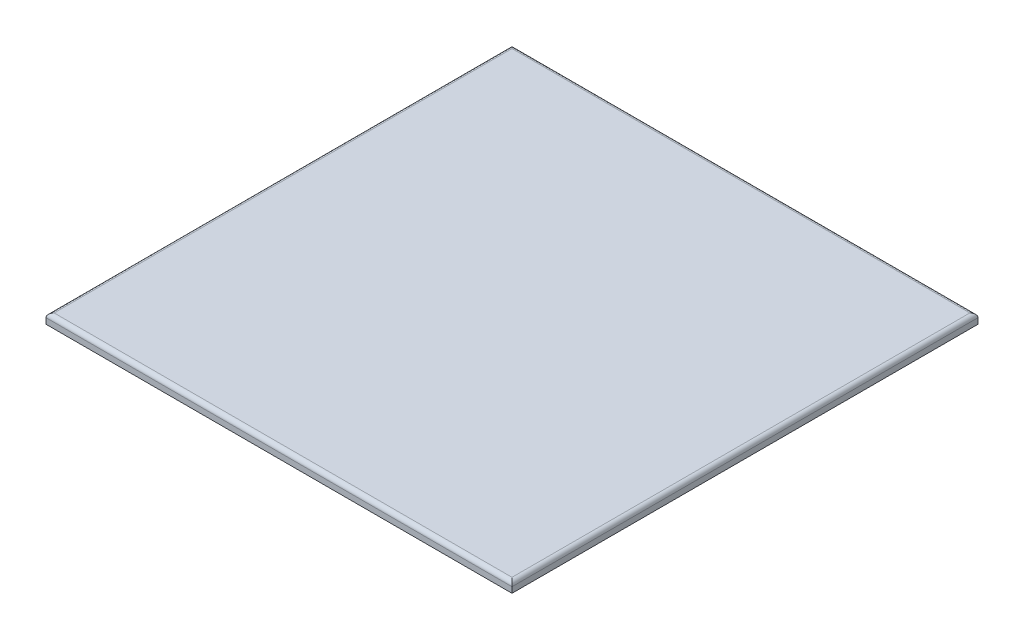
from build123d import *

# Parameters (mm, degrees)
SKETCH2_W           = 145
SKETCH2_H           = 145
BOSS_EXTRUDE1_DEPTH = 3.048
FILLET1_R           = 1.27


with BuildPart() as part:
    # Sketch2 → Boss-Extrude1 (new body)
    with BuildSketch(Plane(origin=(0, 0, 0), x_dir=(1, 0, 0), z_dir=(0, 1, 0))):
        with Locations((72.5, 72.5)):
            Rectangle(SKETCH2_W, SKETCH2_H)
    extrude(amount=BOSS_EXTRUDE1_DEPTH)

    # Fillet1
    fillet1_edges = [part.edges().sort_by_distance(p)[0] for p in [
        (145, 3.048, -72.5),
        (72.5, 3.048, -145),
        (0, 3.048, -72.5),
        (72.5, 3.048, 0),
    ]]
    fillet(fillet1_edges, radius=FILLET1_R)


solid = part.part
